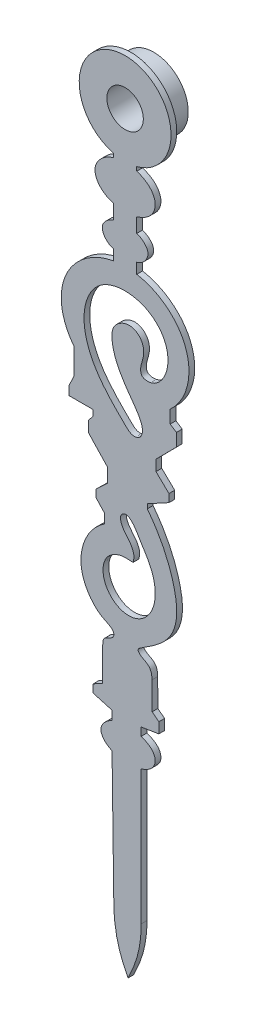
from build123d import *
from build123d.topology import SkipClean

# Parameters (mm, degrees)
SKETCH_1_R      = 3.175
EXTRUDE_1_DEPTH = 1
EXTRUDE_START   = 4
SKETCH_3_R      = 6
SKETCH_3_R_2    = 3.175
EXTRUDE_2_DEPTH = 4


with BuildPart() as part:
    # Sketch 1 → Extrude 1 (new body)
    with BuildSketch(Plane.XY):
        with BuildLine():
            Line((-2.0284, 53.724321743), (-2.0284, 53.0213))
            add(Edge.make_bspline(
                [(-2.0284, 53.0213), (-3.030014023, 52.759447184), (-4.317060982, 51.933484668), (-5.27153256, 50.254989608), (-5.26208842, 48.900460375), (-4.352607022, 47.193773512), (-2.993921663, 46.426013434), (-2.0284, 46.1421)],
                knots=[0, 0, 0, 0, 0.30710885, 0.437945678, 0.561301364, 0.695274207, 1, 1, 1, 1], degree=3))
            Line((-2.0284, 46.1421), (-2.0284, 43.6374))
            add(Edge.make_bspline(
                [(-2.0284, 43.6374), (-2.846135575, 43.345240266), (-5.031735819, 41.700208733), (-3.014671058, 39.45869576), (-2.0284, 39.2982)],
                knots=[0, 0, 0, 0, 0.46221236, 1, 1, 1, 1], degree=3))
            Line((-2.0284, 39.2982), (-2.0284, 37.4638))
            add(Edge.make_bspline(
                [(-2.0284, 37.4638), (-5.228473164, 36.929162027), (-9.67471698, 33.994540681), (-11.771871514, 26.873224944), (-10.333689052, 22.931467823), (-8.8723, 21.1301)],
                knots=[0, 0, 0, 0, 0.45541721, 0.672007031, 1, 1, 1, 1], degree=3))
            Line((-8.8723, 21.1301), (-8.8723, 16.6851))
            Line((-8.8723, 16.6851), (-9.7542, 14.8507))
            Line((-9.7542, 14.8507), (-9.7542, 13.2632))
            Line((-9.7542, 13.2632), (-5.5562, 13.2632))
            Line((-5.5562, 13.2632), (-5.5562, 12.2401))
            Line((-5.5562, 12.2401), (-6.4028, 11.2524))
            Line((-6.4028, 11.2524), (-6.4028, 9.3827))
            Line((-6.4028, 9.3827), (-3.0515, 5.8196))
            Line((-3.0515, 5.8196), (-3.0515, 3.4207))
            Line((-3.0515, 3.4207), (-5.0623, 1.5157))
            Line((-5.0623, 1.5157), (-5.0623, 0.2104))
            Line((-5.0623, 0.2104), (-3.5806, -1.3771))
            Line((-3.5806, -1.3771), (-3.5806, -2.9999))
            add(Edge.make_bspline(
                [(-3.5806, -2.9999), (-5.627911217, -4.341402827), (-7.624939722, -7.36261661), (-7.791688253, -11.770719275), (-6.665962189, -14.755839), (-4.768394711, -17.003084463), (-2.820765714, -17.7587245), (-1.924228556, -18.479050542), (-1.981902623, -19.400182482), (-2.810260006, -19.811177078), (-3.913780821, -20.247167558), (-3.8981, -21.235563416), (-3.8981, -21.6618)],
                knots=[0, 0, 0, 0, 0.312275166, 0.435687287, 0.557102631, 0.720936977, 0.791808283, 0.832793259, 0.85568829, 0.898037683, 0.941145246, 1, 1, 1, 1], degree=3))
            Line((-3.8981, -21.6618), (-3.8981, -27.2004))
            Line((-3.8981, -27.2004), (-5.5562, -28.1176))
            Line((-5.5562, -28.1176), (-5.5562, -29.5287))
            Line((-5.5562, -29.5287), (-2.2753, -30.446))
            Line((-2.2753, -30.446), (-2.2753, -32.0335))
            add(Edge.make_bspline(
                [(-2.2753, -32.0335), (-3.054172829, -32.328804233), (-4.627995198, -33.63958118), (-3.799730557, -35.722715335), (-2.872181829, -36.28795339), (-2.2753, -36.5843)],
                knots=[0, 0, 0, 0, 0.500674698, 0.674613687, 1, 1, 1, 1], degree=3))
            Line((-2.2753, -36.5843), (-1.9578, -60.1499))
            add(Edge.make_bspline(
                [(-1.9578, -60.1499), (-1.94685334, -60.962386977), (-1.778191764, -62.577805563), (-1.197330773, -65.769936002), (-0.243492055, -68.031657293), (0.5116, -69.4632)],
                knots=[0, 0, 0, 0, 0.251367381, 0.499072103, 1, 1, 1, 1], degree=3))
            add(Edge.make_bspline(
                [(0.5116, -69.4632), (1.222024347, -68.019650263), (2.15881005, -65.765926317), (2.710196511, -62.577409), (2.8047, -60.960858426), (2.8047, -60.1499)],
                knots=[0, 0, 0, 0, 0.50013031, 0.748154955, 1, 1, 1, 1], degree=3))
            Line((2.8047, -60.1499), (2.8047, -36.796))
            add(Edge.make_bspline(
                [(2.8047, -31.8571), (3.578794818, -32.149729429), (4.859972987, -32.741975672), (5.34466847, -34.326503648), (4.859945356, -35.911022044), (3.578879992, -36.503427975), (2.8047, -36.796)],
                knots=[0, 0, 0, 0, 0.360268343, 0.499995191, 0.63972204, 1, 1, 1, 1], degree=3))
            Line((2.8047, -31.8571), (2.8047, -30.446))
            Line((2.8047, -30.446), (5.8738, -29.9521))
            Line((5.8738, -29.9521), (5.8738, -28.1176))
            Line((5.8738, -28.1176), (4.7097, -27.2004))
            Line((4.7097, -27.2004), (4.6744, -22.4026))
            add(Edge.make_bspline(
                [(4.6744, -22.4026), (4.667405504, -21.451942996), (4.394180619, -20.63681534), (3.188616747, -19.981105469), (2.545190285, -19.649279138), (2.088254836, -18.949023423), (3.700728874, -17.951404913), (5.377959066, -16.850701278), (8.031041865, -14.536863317), (9.280897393, -10.784674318), (8.377431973, -4.437618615), (6.075862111, 0.182361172), (3.863, 2.9974)],
                knots=[0, 0, 0, 0, 0.066743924, 0.099741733, 0.128204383, 0.14020853, 0.173229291, 0.268947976, 0.375302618, 0.501812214, 0.644629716, 1, 1, 1, 1], degree=3))
            Line((3.863, 2.9974), (3.863, 3.7735))
            Line((3.863, 3.7735), (7.6377, 5.8196))
            Line((7.6377, 5.8196), (7.6377, 7.1954))
            Line((7.6377, 7.1954), (5.3799, 9.3827))
            Line((5.3799, 9.3827), (5.3799, 11.2524))
            Line((5.3799, 11.2524), (8.943, 14.8507))
            Line((8.943, 14.8507), (8.943, 17.0732))
            Line((8.943, 17.0732), (7.8494, 17.7788))
            Line((7.8494, 17.7788), (7.8494, 20.0365))
            add(Edge.make_bspline(
                [(2.0285, 37.4638), (5.268315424, 36.936036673), (9.803867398, 33.922287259), (11.862577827, 26.24348855), (9.909692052, 21.877558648), (7.8494, 20.0365)],
                knots=[0, 0, 0, 0, 0.431377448, 0.637463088, 1, 1, 1, 1], degree=3))
            Line((2.0285, 37.4638), (2.0285, 39.2982))
            add(Edge.make_bspline(
                [(2.0285, 43.6374), (2.864359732, 43.379669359), (5.018539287, 41.684981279), (3.019227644, 39.463768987), (2.0285, 39.2982)],
                knots=[0, 0, 0, 0, 0.463107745, 1, 1, 1, 1], degree=3))
            Line((2.0285, 43.6374), (2.0285, 46.1421))
            add(Edge.make_bspline(
                [(2.0285, 53.0213), (3.002429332, 52.72602064), (4.378958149, 51.967776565), (5.264767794, 50.242695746), (5.255559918, 48.912578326), (4.413967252, 47.159886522), (2.967300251, 46.459309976), (2.0285, 46.1421)],
                knots=[0, 0, 0, 0, 0.309048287, 0.438037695, 0.56113114, 0.693287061, 1, 1, 1, 1], degree=3))
            Line((2.0285, 53.0213), (2.0285, 53.724347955))
            ThreePointArc((2.0285, 53.724347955), (-5.1689e-05, 69.4629), (-2.0284, 53.724321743))
        make_face()
        with Locations((0, 61.4629)):
            Circle(SKETCH_1_R, mode=Mode.SUBTRACT)
        with BuildLine():
            add(Edge.make_bspline(
                [(0.0883, 13.6513), (0.418104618, 13.329385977), (1.048350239, 12.715991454), (2.480600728, 12.827372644), (3.255597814, 14.244120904), (2.662370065, 15.965703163), (1.380116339, 17.877669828), (-0.251712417, 20.01802795), (-1.694337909, 22.663370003), (-2.3763292, 25.191572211), (-2.256394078, 27.464295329), (-0.88531018, 28.774856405), (0.858731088, 29.348982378), (2.66489195, 28.478234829), (3.423746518, 26.660239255), (3.047969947, 24.957449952), (2.614602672, 23.70065972), (2.831837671, 22.286457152), (4.528047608, 22.172921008), (5.939527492, 23.032022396), (7.514790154, 25.270852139), (7.733932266, 29.507590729), (3.501368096, 34.410559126), (-4.610740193, 34.237331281), (-7.89615872, 27.14901), (-5.981866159, 19.652891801), (-2.167843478, 15.853465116), (0.0883, 13.6513)],
                knots=[0, 0, 0, 0, 0.018037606, 0.034281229, 0.049420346, 0.076033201, 0.102238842, 0.143443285, 0.184194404, 0.222748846, 0.249119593, 0.270259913, 0.295354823, 0.318488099, 0.343974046, 0.368400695, 0.386825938, 0.398564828, 0.419409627, 0.439785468, 0.465601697, 0.526454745, 0.594803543, 0.706432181, 0.783272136, 0.87660747, 1, 1, 1, 1], degree=3))
        make_face(mode=Mode.SUBTRACT)
        with BuildLine():
            Line((0.0883, -6.2807), (1.3935, -6.316))
            add(Edge.make_bspline(
                [(1.3935, -6.316), (1.468301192, -5.98627352), (1.666915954, -5.110772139), (1.036064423, -3.703077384), (-0.036870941, -2.56693414), (-0.789910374, -1.401855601), (-0.873983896, -0.148253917), (0.223070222, 0.535072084), (1.602467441, -0.528878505), (2.438603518, -2.213229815), (4.049978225, -4.522262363), (5.377595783, -7.492736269), (5.252528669, -11.012440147), (3.803496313, -13.604574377), (1.421176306, -14.937624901), (-1.392924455, -14.565015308), (-3.482918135, -12.488707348), (-4.052117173, -9.895211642), (-3.162789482, -7.18218736), (-1.127281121, -6.247823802), (0.0883, -6.2807)],
                knots=[0, 0, 0, 0, 0.025126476, 0.066716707, 0.108476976, 0.143853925, 0.171451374, 0.191414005, 0.226375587, 0.282059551, 0.338744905, 0.437224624, 0.522617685, 0.595136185, 0.651569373, 0.718673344, 0.79406002, 0.859392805, 0.909407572, 1, 1, 1, 1], degree=3))
        make_face(mode=Mode.SUBTRACT)
    extrude(amount=EXTRUDE_1_DEPTH)

    # Sketch 3 → Extrude 2 (add)
    with SkipClean():  # the faces are left unmerged after this step: merging them gives an invalid solid
        with BuildSketch(Plane(origin=(0, 0, 0), x_dir=(-1, 0, 0), z_dir=(0, 0, -1)).offset(EXTRUDE_START)):
            with Locations(Location((0, 61.4629, 0), (0, 0, 180))):
                Circle(SKETCH_3_R)
            with Locations((0, 61.4629)):
                Circle(SKETCH_3_R_2, mode=Mode.SUBTRACT)
        extrude(amount=-EXTRUDE_2_DEPTH)


solid = part.part
